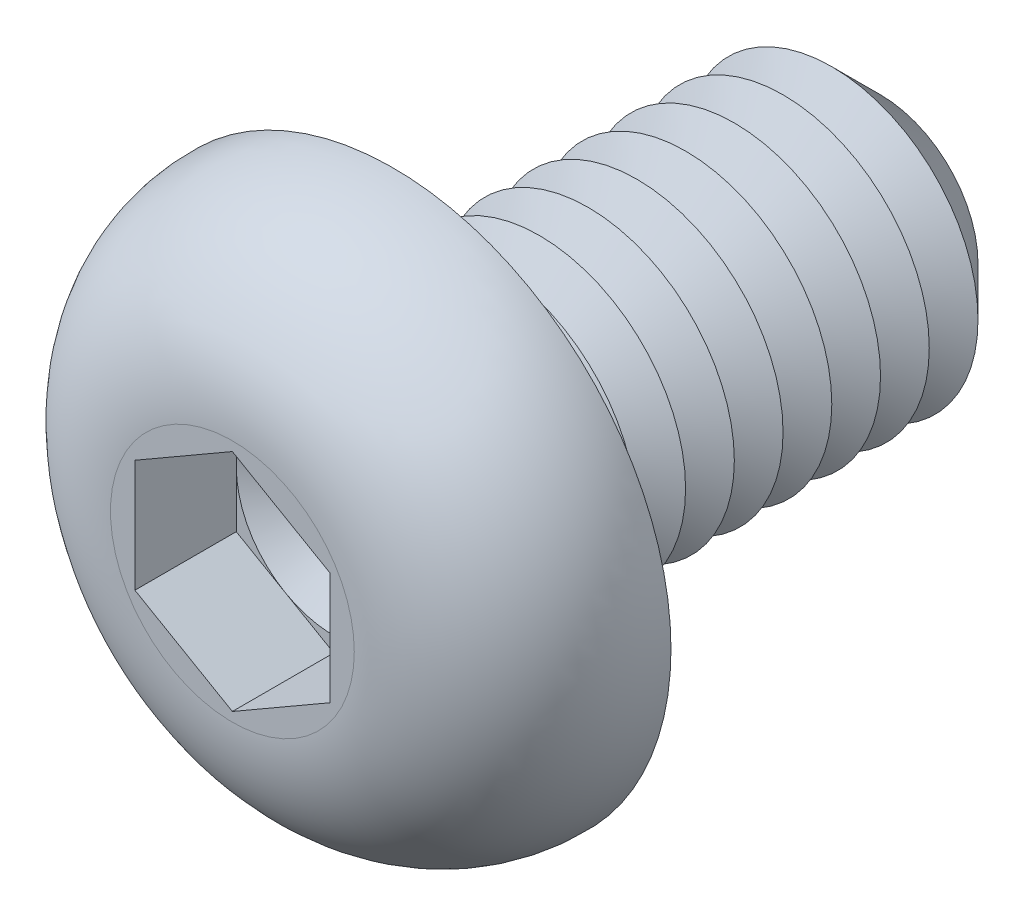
ISO-10303-21;
HEADER;
FILE_DESCRIPTION(('STEP AP214'),'2;1');
FILE_NAME('part.step','',(''),(''),'','','');
FILE_SCHEMA(('AUTOMOTIVE_DESIGN { 1 0 10303 214 1 1 1 1 }'));
ENDSEC;
DATA;
#1=APPLICATION_CONTEXT('core data for automotive mechanical design processes');
#2=APPLICATION_PROTOCOL_DEFINITION('international standard','automotive_design',2000,#1);
#3=PRODUCT_CONTEXT('',#1,'mechanical');
#4=PRODUCT('Part','Part','',(#3));
#5=PRODUCT_RELATED_PRODUCT_CATEGORY('part','',(#4));
#6=PRODUCT_DEFINITION_FORMATION('','',#4);
#7=PRODUCT_DEFINITION_CONTEXT('part definition',#1,'design');
#8=PRODUCT_DEFINITION('design','',#6,#7);
#9=PRODUCT_DEFINITION_SHAPE('','',#8);
#10=(LENGTH_UNIT() NAMED_UNIT(*) SI_UNIT(.MILLI.,.METRE.));
#11=(NAMED_UNIT(*) PLANE_ANGLE_UNIT() SI_UNIT($,.RADIAN.));
#12=(NAMED_UNIT(*) SI_UNIT($,.STERADIAN.) SOLID_ANGLE_UNIT());
#13=UNCERTAINTY_MEASURE_WITH_UNIT(LENGTH_MEASURE(1.E-05),#10,'distance_accuracy_value','');
#14=(GEOMETRIC_REPRESENTATION_CONTEXT(3) GLOBAL_UNCERTAINTY_ASSIGNED_CONTEXT((#13)) GLOBAL_UNIT_ASSIGNED_CONTEXT((#10,
#11,#12)) REPRESENTATION_CONTEXT('',''));
#15=CARTESIAN_POINT('',(0.,0.,0.));
#16=DIRECTION('',(0.,0.,1.));
#17=DIRECTION('',(1.,0.,0.));
#18=AXIS2_PLACEMENT_3D('',#15,#16,#17);
#19=CARTESIAN_POINT('',(0.,0.,0.61));
#20=DIRECTION('',(0.,0.,1.));
#21=DIRECTION('',(1.,0.,0.));
#22=AXIS2_PLACEMENT_3D('',#19,#20,#21);
#23=PLANE('',#22);
#24=CARTESIAN_POINT('',(0.,0.,0.61));
#25=DIRECTION('',(0.,0.,1.));
#26=DIRECTION('',(1.,0.,0.));
#27=AXIS2_PLACEMENT_3D('',#24,#25,#26);
#28=CIRCLE('',#27,1.);
#29=CARTESIAN_POINT('',(1.,0.,0.61));
#30=VERTEX_POINT('',#29);
#31=CARTESIAN_POINT('',(0.5,0.866025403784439,0.61));
#32=VERTEX_POINT('',#31);
#33=EDGE_CURVE('E117',#30,#32,#28,.T.);
#34=ORIENTED_EDGE('',*,*,#33,.F.);
#35=DIRECTION('',(0.,1.,0.));
#36=VECTOR('',#35,1.);
#37=CARTESIAN_POINT('',(1.,-0.577350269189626,0.61));
#38=LINE('',#37,#36);
#39=CARTESIAN_POINT('',(1.,0.577350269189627,0.61));
#40=VERTEX_POINT('',#39);
#41=EDGE_CURVE('E140',#30,#40,#38,.T.);
#42=ORIENTED_EDGE('',*,*,#41,.T.);
#43=DIRECTION('',(-0.866025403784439,0.5,0.));
#44=VECTOR('',#43,1.);
#45=CARTESIAN_POINT('',(1.,0.577350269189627,0.61));
#46=LINE('',#45,#44);
#47=EDGE_CURVE('E135',#40,#32,#46,.T.);
#48=ORIENTED_EDGE('',*,*,#47,.T.);
#49=EDGE_LOOP('',(#34,#42,#48));
#50=FACE_BOUND('',#49,.T.);
#51=ADVANCED_FACE('F39',(#50),#23,.T.);
#52=CARTESIAN_POINT('',(0.,0.,0.61));
#53=DIRECTION('',(0.,0.,1.));
#54=DIRECTION('',(1.,0.,0.));
#55=AXIS2_PLACEMENT_3D('',#52,#53,#54);
#56=CIRCLE('',#55,1.);
#57=CARTESIAN_POINT('',(-0.5,0.866025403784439,0.61));
#58=VERTEX_POINT('',#57);
#59=EDGE_CURVE('E11',#32,#58,#56,.T.);
#60=ORIENTED_EDGE('',*,*,#59,.F.);
#61=CARTESIAN_POINT('',(0.,1.15470053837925,0.61));
#62=VERTEX_POINT('',#61);
#63=EDGE_CURVE('E130',#32,#62,#46,.T.);
#64=ORIENTED_EDGE('',*,*,#63,.T.);
#65=DIRECTION('',(-0.866025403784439,-0.5,0.));
#66=VECTOR('',#65,1.);
#67=CARTESIAN_POINT('',(0.,1.15470053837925,0.61));
#68=LINE('',#67,#66);
#69=EDGE_CURVE('E132',#62,#58,#68,.T.);
#70=ORIENTED_EDGE('',*,*,#69,.T.);
#71=EDGE_LOOP('',(#60,#64,#70));
#72=FACE_BOUND('',#71,.T.);
#73=ADVANCED_FACE('F129',(#72),#23,.T.);
#74=CARTESIAN_POINT('',(-1.,0.,0.61));
#75=VERTEX_POINT('',#74);
#76=EDGE_CURVE('E49',#58,#75,#56,.T.);
#77=ORIENTED_EDGE('',*,*,#76,.F.);
#78=CARTESIAN_POINT('',(-1.,0.577350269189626,0.61));
#79=VERTEX_POINT('',#78);
#80=EDGE_CURVE('E143',#58,#79,#68,.T.);
#81=ORIENTED_EDGE('',*,*,#80,.T.);
#82=DIRECTION('',(0.,-1.,0.));
#83=VECTOR('',#82,1.);
#84=CARTESIAN_POINT('',(-1.,0.577350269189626,0.61));
#85=LINE('',#84,#83);
#86=EDGE_CURVE('E154',#79,#75,#85,.T.);
#87=ORIENTED_EDGE('',*,*,#86,.T.);
#88=EDGE_LOOP('',(#77,#81,#87));
#89=FACE_BOUND('',#88,.T.);
#90=ADVANCED_FACE('F250',(#89),#23,.T.);
#91=CARTESIAN_POINT('',(-0.5,-0.866025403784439,0.61));
#92=VERTEX_POINT('',#91);
#93=EDGE_CURVE('E234',#75,#92,#56,.T.);
#94=ORIENTED_EDGE('',*,*,#93,.F.);
#95=CARTESIAN_POINT('',(-1.,-0.577350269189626,0.61));
#96=VERTEX_POINT('',#95);
#97=EDGE_CURVE('E153',#75,#96,#85,.T.);
#98=ORIENTED_EDGE('',*,*,#97,.T.);
#99=DIRECTION('',(0.866025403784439,-0.5,0.));
#100=VECTOR('',#99,1.);
#101=CARTESIAN_POINT('',(-1.,-0.577350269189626,0.61));
#102=LINE('',#101,#100);
#103=EDGE_CURVE('E159',#96,#92,#102,.T.);
#104=ORIENTED_EDGE('',*,*,#103,.T.);
#105=EDGE_LOOP('',(#94,#98,#104));
#106=FACE_BOUND('',#105,.T.);
#107=ADVANCED_FACE('F243',(#106),#23,.T.);
#108=CARTESIAN_POINT('',(0.5,-0.866025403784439,0.61));
#109=VERTEX_POINT('',#108);
#110=EDGE_CURVE('E56',#92,#109,#56,.T.);
#111=ORIENTED_EDGE('',*,*,#110,.F.);
#112=CARTESIAN_POINT('',(0.,-1.15470053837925,0.61));
#113=VERTEX_POINT('',#112);
#114=EDGE_CURVE('E158',#92,#113,#102,.T.);
#115=ORIENTED_EDGE('',*,*,#114,.T.);
#116=DIRECTION('',(0.866025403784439,0.5,0.));
#117=VECTOR('',#116,1.);
#118=CARTESIAN_POINT('',(0.,-1.15470053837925,0.61));
#119=LINE('',#118,#117);
#120=EDGE_CURVE('E164',#113,#109,#119,.T.);
#121=ORIENTED_EDGE('',*,*,#120,.T.);
#122=EDGE_LOOP('',(#111,#115,#121));
#123=FACE_BOUND('',#122,.T.);
#124=ADVANCED_FACE('F268',(#123),#23,.T.);
#125=CARTESIAN_POINT('',(0.,0.,-5.));
#126=DIRECTION('',(0.,0.,1.));
#127=DIRECTION('',(1.,0.,0.));
#128=AXIS2_PLACEMENT_3D('',#125,#126,#127);
#129=CYLINDRICAL_SURFACE('',#128,1.5);
#130=CARTESIAN_POINT('',(0.,0.,-0.2));
#131=DIRECTION('',(0.,0.,1.));
#132=DIRECTION('',(1.,0.,0.));
#133=AXIS2_PLACEMENT_3D('',#130,#131,#132);
#134=CIRCLE('',#133,1.5);
#135=CARTESIAN_POINT('',(1.5,0.,-0.2));
#136=VERTEX_POINT('',#135);
#137=EDGE_CURVE('E222',#136,#136,#134,.F.);
#138=ORIENTED_EDGE('',*,*,#137,.T.);
#139=EDGE_LOOP('',(#138));
#140=FACE_BOUND('',#139,.T.);
#141=CARTESIAN_POINT('',(0.,0.,-0.5));
#142=DIRECTION('',(0.,0.,1.));
#143=DIRECTION('',(1.,0.,0.));
#144=AXIS2_PLACEMENT_3D('',#141,#142,#143);
#145=CIRCLE('',#144,1.50000000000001);
#146=CARTESIAN_POINT('',(1.50000000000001,0.,-0.5));
#147=VERTEX_POINT('',#146);
#148=EDGE_CURVE('E149',#147,#147,#145,.T.);
#149=ORIENTED_EDGE('',*,*,#148,.T.);
#150=EDGE_LOOP('',(#149));
#151=FACE_BOUND('',#150,.T.);
#152=ADVANCED_FACE('F377',(#140,#151),#129,.T.);
#153=CARTESIAN_POINT('',(0.,2.85,0.));
#154=DIRECTION('',(0.,0.,1.));
#155=DIRECTION('',(1.,0.,0.));
#156=AXIS2_PLACEMENT_3D('',#153,#154,#155);
#157=PLANE('',#156);
#158=CARTESIAN_POINT('',(0.,0.,0.));
#159=DIRECTION('',(0.,0.,1.));
#160=DIRECTION('',(1.,0.,0.));
#161=AXIS2_PLACEMENT_3D('',#158,#159,#160);
#162=CIRCLE('',#161,1.7);
#163=CARTESIAN_POINT('',(1.7,0.,0.));
#164=VERTEX_POINT('',#163);
#165=EDGE_CURVE('E225',#164,#164,#162,.T.);
#166=ORIENTED_EDGE('',*,*,#165,.T.);
#167=EDGE_LOOP('',(#166));
#168=FACE_BOUND('',#167,.T.);
#169=CARTESIAN_POINT('',(0.,0.,0.));
#170=DIRECTION('',(0.,0.,1.));
#171=DIRECTION('',(1.,0.,0.));
#172=AXIS2_PLACEMENT_3D('',#169,#170,#171);
#173=CIRCLE('',#172,2.85);
#174=CARTESIAN_POINT('',(2.85,0.,0.));
#175=VERTEX_POINT('',#174);
#176=EDGE_CURVE('E196',#175,#175,#173,.T.);
#177=ORIENTED_EDGE('',*,*,#176,.F.);
#178=EDGE_LOOP('',(#177));
#179=FACE_BOUND('',#178,.T.);
#180=ADVANCED_FACE('F382',(#168,#179),#157,.F.);
#181=CARTESIAN_POINT('',(0.,0.,1.65));
#182=DIRECTION('',(0.,0.,-1.));
#183=DIRECTION('',(-1.,0.,0.));
#184=AXIS2_PLACEMENT_3D('',#181,#182,#183);
#185=PLANE('',#184);
#186=DIRECTION('',(-0.866025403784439,-0.5,0.));
#187=VECTOR('',#186,1.);
#188=CARTESIAN_POINT('',(0.,1.15470053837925,1.65));
#189=LINE('',#188,#187);
#190=CARTESIAN_POINT('',(0.,1.15470053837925,1.65));
#191=VERTEX_POINT('',#190);
#192=CARTESIAN_POINT('',(-1.,0.577350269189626,1.65));
#193=VERTEX_POINT('',#192);
#194=EDGE_CURVE('E174',#191,#193,#189,.T.);
#195=ORIENTED_EDGE('',*,*,#194,.F.);
#196=DIRECTION('',(-0.866025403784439,0.5,0.));
#197=VECTOR('',#196,1.);
#198=CARTESIAN_POINT('',(1.,0.577350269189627,1.65));
#199=LINE('',#198,#197);
#200=CARTESIAN_POINT('',(1.,0.577350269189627,1.65));
#201=VERTEX_POINT('',#200);
#202=EDGE_CURVE('E64',#201,#191,#199,.T.);
#203=ORIENTED_EDGE('',*,*,#202,.F.);
#204=DIRECTION('',(0.,1.,0.));
#205=VECTOR('',#204,1.);
#206=CARTESIAN_POINT('',(1.,-0.577350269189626,1.65));
#207=LINE('',#206,#205);
#208=CARTESIAN_POINT('',(1.,-0.577350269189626,1.65));
#209=VERTEX_POINT('',#208);
#210=EDGE_CURVE('E138',#209,#201,#207,.T.);
#211=ORIENTED_EDGE('',*,*,#210,.F.);
#212=DIRECTION('',(0.866025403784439,0.5,0.));
#213=VECTOR('',#212,1.);
#214=CARTESIAN_POINT('',(0.,-1.15470053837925,1.65));
#215=LINE('',#214,#213);
#216=CARTESIAN_POINT('',(0.,-1.15470053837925,1.65));
#217=VERTEX_POINT('',#216);
#218=EDGE_CURVE('E186',#217,#209,#215,.T.);
#219=ORIENTED_EDGE('',*,*,#218,.F.);
#220=DIRECTION('',(0.866025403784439,-0.5,0.));
#221=VECTOR('',#220,1.);
#222=CARTESIAN_POINT('',(-1.,-0.577350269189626,1.65));
#223=LINE('',#222,#221);
#224=CARTESIAN_POINT('',(-1.,-0.577350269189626,1.65));
#225=VERTEX_POINT('',#224);
#226=EDGE_CURVE('E182',#225,#217,#223,.T.);
#227=ORIENTED_EDGE('',*,*,#226,.F.);
#228=DIRECTION('',(0.,-1.,0.));
#229=VECTOR('',#228,1.);
#230=CARTESIAN_POINT('',(-1.,0.577350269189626,1.65));
#231=LINE('',#230,#229);
#232=EDGE_CURVE('E178',#193,#225,#231,.T.);
#233=ORIENTED_EDGE('',*,*,#232,.F.);
#234=EDGE_LOOP('',(#195,#203,#211,#219,#227,#233));
#235=FACE_BOUND('',#234,.T.);
#236=CARTESIAN_POINT('',(0.,0.,1.65));
#237=DIRECTION('',(0.,0.,1.));
#238=DIRECTION('',(1.,0.,0.));
#239=AXIS2_PLACEMENT_3D('',#236,#237,#238);
#240=CIRCLE('',#239,1.25078144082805);
#241=CARTESIAN_POINT('',(1.25078144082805,0.,1.65));
#242=VERTEX_POINT('',#241);
#243=EDGE_CURVE('E214',#242,#242,#240,.T.);
#244=ORIENTED_EDGE('',*,*,#243,.T.);
#245=EDGE_LOOP('',(#244));
#246=FACE_BOUND('',#245,.T.);
#247=ADVANCED_FACE('F259',(#235,#246),#185,.F.);
#248=CARTESIAN_POINT('',(0.,0.,0.0499999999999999));
#249=DIRECTION('',(0.,0.,1.));
#250=DIRECTION('',(1.,0.,0.));
#251=AXIS2_PLACEMENT_3D('',#248,#249,#250);
#252=DEGENERATE_TOROIDAL_SURFACE('',#251,1.25078144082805,1.6,.T.);
#253=ORIENTED_EDGE('',*,*,#243,.F.);
#254=EDGE_LOOP('',(#253));
#255=FACE_BOUND('',#254,.T.);
#256=ORIENTED_EDGE('',*,*,#176,.T.);
#257=EDGE_LOOP('',(#256));
#258=FACE_BOUND('',#257,.T.);
#259=ADVANCED_FACE('F593',(#255,#258),#252,.T.);
#260=CARTESIAN_POINT('',(1.,0.577350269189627,0.61));
#261=DIRECTION('',(0.5,0.866025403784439,0.));
#262=DIRECTION('',(-0.866025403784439,0.5,0.));
#263=AXIS2_PLACEMENT_3D('',#260,#261,#262);
#264=PLANE('',#263);
#265=ORIENTED_EDGE('',*,*,#202,.T.);
#266=DIRECTION('',(0.,0.,1.));
#267=VECTOR('',#266,1.);
#268=CARTESIAN_POINT('',(0.,1.15470053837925,0.61));
#269=LINE('',#268,#267);
#270=EDGE_CURVE('E136',#62,#191,#269,.T.);
#271=ORIENTED_EDGE('',*,*,#270,.F.);
#272=ORIENTED_EDGE('',*,*,#63,.F.);
#273=ORIENTED_EDGE('',*,*,#47,.F.);
#274=DIRECTION('',(0.,0.,1.));
#275=VECTOR('',#274,1.);
#276=CARTESIAN_POINT('',(1.,0.577350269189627,0.61));
#277=LINE('',#276,#275);
#278=EDGE_CURVE('E193',#40,#201,#277,.T.);
#279=ORIENTED_EDGE('',*,*,#278,.T.);
#280=EDGE_LOOP('',(#265,#271,#272,#273,#279));
#281=FACE_BOUND('',#280,.T.);
#282=ADVANCED_FACE('F134',(#281),#264,.F.);
#283=CARTESIAN_POINT('',(1.,-0.577350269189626,0.61));
#284=DIRECTION('',(1.,0.,0.));
#285=DIRECTION('',(0.,0.,-1.));
#286=AXIS2_PLACEMENT_3D('',#283,#284,#285);
#287=PLANE('',#286);
#288=ORIENTED_EDGE('',*,*,#210,.T.);
#289=ORIENTED_EDGE('',*,*,#278,.F.);
#290=ORIENTED_EDGE('',*,*,#41,.F.);
#291=CARTESIAN_POINT('',(1.,-0.577350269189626,0.61));
#292=VERTEX_POINT('',#291);
#293=EDGE_CURVE('E168',#292,#30,#38,.T.);
#294=ORIENTED_EDGE('',*,*,#293,.F.);
#295=DIRECTION('',(0.,0.,1.));
#296=VECTOR('',#295,1.);
#297=CARTESIAN_POINT('',(1.,-0.577350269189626,0.61));
#298=LINE('',#297,#296);
#299=EDGE_CURVE('E197',#292,#209,#298,.T.);
#300=ORIENTED_EDGE('',*,*,#299,.T.);
#301=EDGE_LOOP('',(#288,#289,#290,#294,#300));
#302=FACE_BOUND('',#301,.T.);
#303=ADVANCED_FACE('F611',(#302),#287,.F.);
#304=CARTESIAN_POINT('',(0.,-1.15470053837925,0.61));
#305=DIRECTION('',(0.5,-0.866025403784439,0.));
#306=DIRECTION('',(0.866025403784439,0.5,0.));
#307=AXIS2_PLACEMENT_3D('',#304,#305,#306);
#308=PLANE('',#307);
#309=ORIENTED_EDGE('',*,*,#218,.T.);
#310=ORIENTED_EDGE('',*,*,#299,.F.);
#311=EDGE_CURVE('E163',#109,#292,#119,.T.);
#312=ORIENTED_EDGE('',*,*,#311,.F.);
#313=ORIENTED_EDGE('',*,*,#120,.F.);
#314=DIRECTION('',(0.,0.,1.));
#315=VECTOR('',#314,1.);
#316=CARTESIAN_POINT('',(0.,-1.15470053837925,0.61));
#317=LINE('',#316,#315);
#318=EDGE_CURVE('E200',#113,#217,#317,.T.);
#319=ORIENTED_EDGE('',*,*,#318,.T.);
#320=EDGE_LOOP('',(#309,#310,#312,#313,#319));
#321=FACE_BOUND('',#320,.T.);
#322=ADVANCED_FACE('F271',(#321),#308,.F.);
#323=CARTESIAN_POINT('',(-1.,-0.577350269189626,0.61));
#324=DIRECTION('',(-0.5,-0.866025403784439,0.));
#325=DIRECTION('',(0.866025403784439,-0.5,0.));
#326=AXIS2_PLACEMENT_3D('',#323,#324,#325);
#327=PLANE('',#326);
#328=ORIENTED_EDGE('',*,*,#226,.T.);
#329=ORIENTED_EDGE('',*,*,#318,.F.);
#330=ORIENTED_EDGE('',*,*,#114,.F.);
#331=ORIENTED_EDGE('',*,*,#103,.F.);
#332=DIRECTION('',(0.,0.,1.));
#333=VECTOR('',#332,1.);
#334=CARTESIAN_POINT('',(-1.,-0.577350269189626,0.61));
#335=LINE('',#334,#333);
#336=EDGE_CURVE('E203',#96,#225,#335,.T.);
#337=ORIENTED_EDGE('',*,*,#336,.T.);
#338=EDGE_LOOP('',(#328,#329,#330,#331,#337));
#339=FACE_BOUND('',#338,.T.);
#340=ADVANCED_FACE('F264',(#339),#327,.F.);
#341=CARTESIAN_POINT('',(-1.,0.577350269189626,0.61));
#342=DIRECTION('',(-1.,0.,0.));
#343=DIRECTION('',(0.,-1.,0.));
#344=AXIS2_PLACEMENT_3D('',#341,#342,#343);
#345=PLANE('',#344);
#346=ORIENTED_EDGE('',*,*,#232,.T.);
#347=ORIENTED_EDGE('',*,*,#336,.F.);
#348=ORIENTED_EDGE('',*,*,#97,.F.);
#349=ORIENTED_EDGE('',*,*,#86,.F.);
#350=DIRECTION('',(0.,0.,1.));
#351=VECTOR('',#350,1.);
#352=CARTESIAN_POINT('',(-1.,0.577350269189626,0.61));
#353=LINE('',#352,#351);
#354=EDGE_CURVE('E206',#79,#193,#353,.T.);
#355=ORIENTED_EDGE('',*,*,#354,.T.);
#356=EDGE_LOOP('',(#346,#347,#348,#349,#355));
#357=FACE_BOUND('',#356,.T.);
#358=ADVANCED_FACE('F248',(#357),#345,.F.);
#359=CARTESIAN_POINT('',(0.,1.15470053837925,0.61));
#360=DIRECTION('',(-0.5,0.866025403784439,0.));
#361=DIRECTION('',(-0.866025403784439,-0.5,0.));
#362=AXIS2_PLACEMENT_3D('',#359,#360,#361);
#363=PLANE('',#362);
#364=ORIENTED_EDGE('',*,*,#194,.T.);
#365=ORIENTED_EDGE('',*,*,#354,.F.);
#366=ORIENTED_EDGE('',*,*,#80,.F.);
#367=ORIENTED_EDGE('',*,*,#69,.F.);
#368=ORIENTED_EDGE('',*,*,#270,.T.);
#369=EDGE_LOOP('',(#364,#365,#366,#367,#368));
#370=FACE_BOUND('',#369,.T.);
#371=ADVANCED_FACE('F253',(#370),#363,.F.);
#372=EDGE_CURVE('E43',#109,#30,#56,.T.);
#373=ORIENTED_EDGE('',*,*,#372,.F.);
#374=ORIENTED_EDGE('',*,*,#311,.T.);
#375=ORIENTED_EDGE('',*,*,#293,.T.);
#376=EDGE_LOOP('',(#373,#374,#375));
#377=FACE_BOUND('',#376,.T.);
#378=ADVANCED_FACE('F363',(#377),#23,.T.);
#379=CARTESIAN_POINT('',(0.,0.,-0.5));
#380=DIRECTION('',(0.,0.,1.));
#381=DIRECTION('',(1.,0.,0.));
#382=AXIS2_PLACEMENT_3D('',#379,#380,#381);
#383=CONICAL_SURFACE('',#382,1.50000000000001,1.0471975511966);
#384=CARTESIAN_POINT('',(0.,0.,-0.750000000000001));
#385=DIRECTION('',(0.,0.,1.));
#386=DIRECTION('',(1.,0.,0.));
#387=AXIS2_PLACEMENT_3D('',#384,#385,#386);
#388=CIRCLE('',#387,1.06698729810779);
#389=CARTESIAN_POINT('',(1.06698729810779,0.,-0.750000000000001));
#390=VERTEX_POINT('',#389);
#391=EDGE_CURVE('E299',#390,#390,#388,.T.);
#392=ORIENTED_EDGE('',*,*,#391,.T.);
#393=EDGE_LOOP('',(#392));
#394=FACE_BOUND('',#393,.T.);
#395=ORIENTED_EDGE('',*,*,#148,.F.);
#396=EDGE_LOOP('',(#395));
#397=FACE_BOUND('',#396,.T.);
#398=ADVANCED_FACE('F369',(#394,#397),#383,.T.);
#399=CARTESIAN_POINT('',(0.,0.,-0.750000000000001));
#400=DIRECTION('',(0.,0.,-1.));
#401=DIRECTION('',(-1.,0.,0.));
#402=AXIS2_PLACEMENT_3D('',#399,#400,#401);
#403=CONICAL_SURFACE('',#402,1.06698729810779,1.0471975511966);
#404=CARTESIAN_POINT('',(0.,0.,-1.));
#405=DIRECTION('',(0.,0.,1.));
#406=DIRECTION('',(1.,0.,0.));
#407=AXIS2_PLACEMENT_3D('',#404,#405,#406);
#408=CIRCLE('',#407,1.50000000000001);
#409=CARTESIAN_POINT('',(1.50000000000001,0.,-1.));
#410=VERTEX_POINT('',#409);
#411=EDGE_CURVE('E304',#410,#410,#408,.T.);
#412=ORIENTED_EDGE('',*,*,#411,.T.);
#413=EDGE_LOOP('',(#412));
#414=FACE_BOUND('',#413,.T.);
#415=ORIENTED_EDGE('',*,*,#391,.F.);
#416=EDGE_LOOP('',(#415));
#417=FACE_BOUND('',#416,.T.);
#418=ADVANCED_FACE('F374',(#414,#417),#403,.T.);
#419=CARTESIAN_POINT('',(0.,0.,-1.));
#420=DIRECTION('',(0.,0.,1.));
#421=DIRECTION('',(1.,0.,0.));
#422=AXIS2_PLACEMENT_3D('',#419,#420,#421);
#423=CONICAL_SURFACE('',#422,1.50000000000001,1.0471975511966);
#424=CARTESIAN_POINT('',(0.,0.,-1.25));
#425=DIRECTION('',(0.,0.,1.));
#426=DIRECTION('',(1.,0.,0.));
#427=AXIS2_PLACEMENT_3D('',#424,#425,#426);
#428=CIRCLE('',#427,1.06698729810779);
#429=CARTESIAN_POINT('',(1.06698729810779,0.,-1.25));
#430=VERTEX_POINT('',#429);
#431=EDGE_CURVE('E309',#430,#430,#428,.T.);
#432=ORIENTED_EDGE('',*,*,#431,.T.);
#433=EDGE_LOOP('',(#432));
#434=FACE_BOUND('',#433,.T.);
#435=ORIENTED_EDGE('',*,*,#411,.F.);
#436=EDGE_LOOP('',(#435));
#437=FACE_BOUND('',#436,.T.);
#438=ADVANCED_FACE('F552',(#434,#437),#423,.T.);
#439=CARTESIAN_POINT('',(0.,0.,-1.25));
#440=DIRECTION('',(0.,0.,-1.));
#441=DIRECTION('',(-1.,0.,0.));
#442=AXIS2_PLACEMENT_3D('',#439,#440,#441);
#443=CONICAL_SURFACE('',#442,1.06698729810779,1.0471975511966);
#444=CARTESIAN_POINT('',(0.,0.,-1.5));
#445=DIRECTION('',(0.,0.,1.));
#446=DIRECTION('',(1.,0.,0.));
#447=AXIS2_PLACEMENT_3D('',#444,#445,#446);
#448=CIRCLE('',#447,1.50000000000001);
#449=CARTESIAN_POINT('',(1.50000000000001,0.,-1.5));
#450=VERTEX_POINT('',#449);
#451=EDGE_CURVE('E315',#450,#450,#448,.T.);
#452=ORIENTED_EDGE('',*,*,#451,.T.);
#453=EDGE_LOOP('',(#452));
#454=FACE_BOUND('',#453,.T.);
#455=ORIENTED_EDGE('',*,*,#431,.F.);
#456=EDGE_LOOP('',(#455));
#457=FACE_BOUND('',#456,.T.);
#458=ADVANCED_FACE('F542',(#454,#457),#443,.T.);
#459=CARTESIAN_POINT('',(0.,0.,-1.5));
#460=DIRECTION('',(0.,0.,1.));
#461=DIRECTION('',(1.,0.,0.));
#462=AXIS2_PLACEMENT_3D('',#459,#460,#461);
#463=CONICAL_SURFACE('',#462,1.50000000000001,1.0471975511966);
#464=CARTESIAN_POINT('',(0.,0.,-1.75));
#465=DIRECTION('',(0.,0.,1.));
#466=DIRECTION('',(1.,0.,0.));
#467=AXIS2_PLACEMENT_3D('',#464,#465,#466);
#468=CIRCLE('',#467,1.06698729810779);
#469=CARTESIAN_POINT('',(1.06698729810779,0.,-1.75));
#470=VERTEX_POINT('',#469);
#471=EDGE_CURVE('E294',#470,#470,#468,.T.);
#472=ORIENTED_EDGE('',*,*,#471,.T.);
#473=EDGE_LOOP('',(#472));
#474=FACE_BOUND('',#473,.T.);
#475=ORIENTED_EDGE('',*,*,#451,.F.);
#476=EDGE_LOOP('',(#475));
#477=FACE_BOUND('',#476,.T.);
#478=ADVANCED_FACE('F532',(#474,#477),#463,.T.);
#479=CARTESIAN_POINT('',(0.,0.,-1.75));
#480=DIRECTION('',(0.,0.,-1.));
#481=DIRECTION('',(-1.,0.,0.));
#482=AXIS2_PLACEMENT_3D('',#479,#480,#481);
#483=CONICAL_SURFACE('',#482,1.06698729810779,1.0471975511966);
#484=CARTESIAN_POINT('',(0.,0.,-2.));
#485=DIRECTION('',(0.,0.,1.));
#486=DIRECTION('',(1.,0.,0.));
#487=AXIS2_PLACEMENT_3D('',#484,#485,#486);
#488=CIRCLE('',#487,1.50000000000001);
#489=CARTESIAN_POINT('',(1.50000000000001,0.,-2.));
#490=VERTEX_POINT('',#489);
#491=EDGE_CURVE('E292',#490,#490,#488,.T.);
#492=ORIENTED_EDGE('',*,*,#491,.T.);
#493=EDGE_LOOP('',(#492));
#494=FACE_BOUND('',#493,.T.);
#495=ORIENTED_EDGE('',*,*,#471,.F.);
#496=EDGE_LOOP('',(#495));
#497=FACE_BOUND('',#496,.T.);
#498=ADVANCED_FACE('F522',(#494,#497),#483,.T.);
#499=CARTESIAN_POINT('',(0.,0.,-2.));
#500=DIRECTION('',(0.,0.,1.));
#501=DIRECTION('',(1.,0.,0.));
#502=AXIS2_PLACEMENT_3D('',#499,#500,#501);
#503=CONICAL_SURFACE('',#502,1.50000000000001,1.0471975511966);
#504=CARTESIAN_POINT('',(0.,0.,-2.25));
#505=DIRECTION('',(0.,0.,1.));
#506=DIRECTION('',(1.,0.,0.));
#507=AXIS2_PLACEMENT_3D('',#504,#505,#506);
#508=CIRCLE('',#507,1.06698729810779);
#509=CARTESIAN_POINT('',(1.06698729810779,0.,-2.25));
#510=VERTEX_POINT('',#509);
#511=EDGE_CURVE('E289',#510,#510,#508,.T.);
#512=ORIENTED_EDGE('',*,*,#511,.T.);
#513=EDGE_LOOP('',(#512));
#514=FACE_BOUND('',#513,.T.);
#515=ORIENTED_EDGE('',*,*,#491,.F.);
#516=EDGE_LOOP('',(#515));
#517=FACE_BOUND('',#516,.T.);
#518=ADVANCED_FACE('F512',(#514,#517),#503,.T.);
#519=CARTESIAN_POINT('',(0.,0.,-2.25));
#520=DIRECTION('',(0.,0.,-1.));
#521=DIRECTION('',(-1.,0.,0.));
#522=AXIS2_PLACEMENT_3D('',#519,#520,#521);
#523=CONICAL_SURFACE('',#522,1.06698729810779,1.0471975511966);
#524=CARTESIAN_POINT('',(0.,0.,-2.5));
#525=DIRECTION('',(0.,0.,1.));
#526=DIRECTION('',(1.,0.,0.));
#527=AXIS2_PLACEMENT_3D('',#524,#525,#526);
#528=CIRCLE('',#527,1.50000000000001);
#529=CARTESIAN_POINT('',(1.50000000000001,0.,-2.5));
#530=VERTEX_POINT('',#529);
#531=EDGE_CURVE('E285',#530,#530,#528,.T.);
#532=ORIENTED_EDGE('',*,*,#531,.T.);
#533=EDGE_LOOP('',(#532));
#534=FACE_BOUND('',#533,.T.);
#535=ORIENTED_EDGE('',*,*,#511,.F.);
#536=EDGE_LOOP('',(#535));
#537=FACE_BOUND('',#536,.T.);
#538=ADVANCED_FACE('F502',(#534,#537),#523,.T.);
#539=CARTESIAN_POINT('',(0.,0.,-2.5));
#540=DIRECTION('',(0.,0.,1.));
#541=DIRECTION('',(1.,0.,0.));
#542=AXIS2_PLACEMENT_3D('',#539,#540,#541);
#543=CONICAL_SURFACE('',#542,1.50000000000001,1.0471975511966);
#544=CARTESIAN_POINT('',(0.,0.,-2.75));
#545=DIRECTION('',(0.,0.,1.));
#546=DIRECTION('',(1.,0.,0.));
#547=AXIS2_PLACEMENT_3D('',#544,#545,#546);
#548=CIRCLE('',#547,1.06698729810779);
#549=CARTESIAN_POINT('',(1.06698729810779,0.,-2.75));
#550=VERTEX_POINT('',#549);
#551=EDGE_CURVE('E283',#550,#550,#548,.T.);
#552=ORIENTED_EDGE('',*,*,#551,.T.);
#553=EDGE_LOOP('',(#552));
#554=FACE_BOUND('',#553,.T.);
#555=ORIENTED_EDGE('',*,*,#531,.F.);
#556=EDGE_LOOP('',(#555));
#557=FACE_BOUND('',#556,.T.);
#558=ADVANCED_FACE('F492',(#554,#557),#543,.T.);
#559=CARTESIAN_POINT('',(0.,0.,-2.75));
#560=DIRECTION('',(0.,0.,-1.));
#561=DIRECTION('',(-1.,0.,0.));
#562=AXIS2_PLACEMENT_3D('',#559,#560,#561);
#563=CONICAL_SURFACE('',#562,1.06698729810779,1.0471975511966);
#564=CARTESIAN_POINT('',(0.,0.,-3.));
#565=DIRECTION('',(0.,0.,1.));
#566=DIRECTION('',(1.,0.,0.));
#567=AXIS2_PLACEMENT_3D('',#564,#565,#566);
#568=CIRCLE('',#567,1.50000000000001);
#569=CARTESIAN_POINT('',(1.50000000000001,0.,-3.));
#570=VERTEX_POINT('',#569);
#571=EDGE_CURVE('E277',#570,#570,#568,.T.);
#572=ORIENTED_EDGE('',*,*,#571,.T.);
#573=EDGE_LOOP('',(#572));
#574=FACE_BOUND('',#573,.T.);
#575=ORIENTED_EDGE('',*,*,#551,.F.);
#576=EDGE_LOOP('',(#575));
#577=FACE_BOUND('',#576,.T.);
#578=ADVANCED_FACE('F482',(#574,#577),#563,.T.);
#579=CARTESIAN_POINT('',(0.,0.,-3.));
#580=DIRECTION('',(0.,0.,1.));
#581=DIRECTION('',(1.,0.,0.));
#582=AXIS2_PLACEMENT_3D('',#579,#580,#581);
#583=CONICAL_SURFACE('',#582,1.50000000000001,1.0471975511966);
#584=CARTESIAN_POINT('',(0.,0.,-3.25));
#585=DIRECTION('',(0.,0.,1.));
#586=DIRECTION('',(1.,0.,0.));
#587=AXIS2_PLACEMENT_3D('',#584,#585,#586);
#588=CIRCLE('',#587,1.06698729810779);
#589=CARTESIAN_POINT('',(1.06698729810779,0.,-3.25));
#590=VERTEX_POINT('',#589);
#591=EDGE_CURVE('E326',#590,#590,#588,.T.);
#592=ORIENTED_EDGE('',*,*,#591,.T.);
#593=EDGE_LOOP('',(#592));
#594=FACE_BOUND('',#593,.T.);
#595=ORIENTED_EDGE('',*,*,#571,.F.);
#596=EDGE_LOOP('',(#595));
#597=FACE_BOUND('',#596,.T.);
#598=ADVANCED_FACE('F472',(#594,#597),#583,.T.);
#599=CARTESIAN_POINT('',(0.,0.,-3.25));
#600=DIRECTION('',(0.,0.,-1.));
#601=DIRECTION('',(-1.,0.,0.));
#602=AXIS2_PLACEMENT_3D('',#599,#600,#601);
#603=CONICAL_SURFACE('',#602,1.06698729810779,1.0471975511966);
#604=CARTESIAN_POINT('',(0.,0.,-3.5));
#605=DIRECTION('',(0.,0.,1.));
#606=DIRECTION('',(1.,0.,0.));
#607=AXIS2_PLACEMENT_3D('',#604,#605,#606);
#608=CIRCLE('',#607,1.50000000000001);
#609=CARTESIAN_POINT('',(1.50000000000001,0.,-3.5));
#610=VERTEX_POINT('',#609);
#611=EDGE_CURVE('E329',#610,#610,#608,.T.);
#612=ORIENTED_EDGE('',*,*,#611,.T.);
#613=EDGE_LOOP('',(#612));
#614=FACE_BOUND('',#613,.T.);
#615=ORIENTED_EDGE('',*,*,#591,.F.);
#616=EDGE_LOOP('',(#615));
#617=FACE_BOUND('',#616,.T.);
#618=ADVANCED_FACE('F462',(#614,#617),#603,.T.);
#619=CARTESIAN_POINT('',(0.,0.,-3.5));
#620=DIRECTION('',(0.,0.,1.));
#621=DIRECTION('',(1.,0.,0.));
#622=AXIS2_PLACEMENT_3D('',#619,#620,#621);
#623=CONICAL_SURFACE('',#622,1.50000000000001,1.0471975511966);
#624=CARTESIAN_POINT('',(0.,0.,-3.75));
#625=DIRECTION('',(0.,0.,1.));
#626=DIRECTION('',(1.,0.,0.));
#627=AXIS2_PLACEMENT_3D('',#624,#625,#626);
#628=CIRCLE('',#627,1.06698729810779);
#629=CARTESIAN_POINT('',(1.06698729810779,0.,-3.75));
#630=VERTEX_POINT('',#629);
#631=EDGE_CURVE('E333',#630,#630,#628,.T.);
#632=ORIENTED_EDGE('',*,*,#631,.T.);
#633=EDGE_LOOP('',(#632));
#634=FACE_BOUND('',#633,.T.);
#635=ORIENTED_EDGE('',*,*,#611,.F.);
#636=EDGE_LOOP('',(#635));
#637=FACE_BOUND('',#636,.T.);
#638=ADVANCED_FACE('F452',(#634,#637),#623,.T.);
#639=CARTESIAN_POINT('',(0.,0.,-3.75));
#640=DIRECTION('',(0.,0.,-1.));
#641=DIRECTION('',(-1.,0.,0.));
#642=AXIS2_PLACEMENT_3D('',#639,#640,#641);
#643=CONICAL_SURFACE('',#642,1.06698729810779,1.0471975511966);
#644=CARTESIAN_POINT('',(0.,0.,-4.));
#645=DIRECTION('',(0.,0.,1.));
#646=DIRECTION('',(1.,0.,0.));
#647=AXIS2_PLACEMENT_3D('',#644,#645,#646);
#648=CIRCLE('',#647,1.50000000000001);
#649=CARTESIAN_POINT('',(1.50000000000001,0.,-4.));
#650=VERTEX_POINT('',#649);
#651=EDGE_CURVE('E336',#650,#650,#648,.T.);
#652=ORIENTED_EDGE('',*,*,#651,.T.);
#653=EDGE_LOOP('',(#652));
#654=FACE_BOUND('',#653,.T.);
#655=ORIENTED_EDGE('',*,*,#631,.F.);
#656=EDGE_LOOP('',(#655));
#657=FACE_BOUND('',#656,.T.);
#658=ADVANCED_FACE('F442',(#654,#657),#643,.T.);
#659=CARTESIAN_POINT('',(0.,0.,-4.));
#660=DIRECTION('',(0.,0.,1.));
#661=DIRECTION('',(1.,0.,0.));
#662=AXIS2_PLACEMENT_3D('',#659,#660,#661);
#663=CONICAL_SURFACE('',#662,1.50000000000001,1.0471975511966);
#664=CARTESIAN_POINT('',(0.,0.,-4.25));
#665=DIRECTION('',(0.,0.,1.));
#666=DIRECTION('',(1.,0.,0.));
#667=AXIS2_PLACEMENT_3D('',#664,#665,#666);
#668=CIRCLE('',#667,1.06698729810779);
#669=CARTESIAN_POINT('',(1.06698729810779,0.,-4.25));
#670=VERTEX_POINT('',#669);
#671=EDGE_CURVE('E124',#670,#670,#668,.T.);
#672=ORIENTED_EDGE('',*,*,#671,.T.);
#673=EDGE_LOOP('',(#672));
#674=FACE_BOUND('',#673,.T.);
#675=ORIENTED_EDGE('',*,*,#651,.F.);
#676=EDGE_LOOP('',(#675));
#677=FACE_BOUND('',#676,.T.);
#678=ADVANCED_FACE('F357',(#674,#677),#663,.T.);
#679=CARTESIAN_POINT('',(0.,0.,-4.25));
#680=DIRECTION('',(0.,0.,-1.));
#681=DIRECTION('',(-1.,0.,0.));
#682=AXIS2_PLACEMENT_3D('',#679,#680,#681);
#683=CONICAL_SURFACE('',#682,1.06698729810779,1.0471975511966);
#684=CARTESIAN_POINT('',(0.,0.,-4.5));
#685=DIRECTION('',(0.,0.,1.));
#686=DIRECTION('',(1.,0.,0.));
#687=AXIS2_PLACEMENT_3D('',#684,#685,#686);
#688=CIRCLE('',#687,1.50000000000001);
#689=CARTESIAN_POINT('',(1.50000000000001,0.,-4.5));
#690=VERTEX_POINT('',#689);
#691=EDGE_CURVE('E281',#690,#690,#688,.T.);
#692=ORIENTED_EDGE('',*,*,#691,.T.);
#693=EDGE_LOOP('',(#692));
#694=FACE_BOUND('',#693,.T.);
#695=ORIENTED_EDGE('',*,*,#671,.F.);
#696=EDGE_LOOP('',(#695));
#697=FACE_BOUND('',#696,.T.);
#698=ADVANCED_FACE('F343',(#694,#697),#683,.T.);
#699=CARTESIAN_POINT('',(0.,0.,-5.));
#700=DIRECTION('',(0.,0.,-1.));
#701=DIRECTION('',(-1.,0.,0.));
#702=AXIS2_PLACEMENT_3D('',#699,#700,#701);
#703=PLANE('',#702);
#704=CARTESIAN_POINT('',(0.,0.,-5.));
#705=DIRECTION('',(0.,0.,-1.));
#706=DIRECTION('',(-1.,0.,0.));
#707=AXIS2_PLACEMENT_3D('',#704,#705,#706);
#708=CIRCLE('',#707,1.);
#709=CARTESIAN_POINT('',(-1.,0.,-5.));
#710=VERTEX_POINT('',#709);
#711=EDGE_CURVE('E218',#710,#710,#708,.T.);
#712=ORIENTED_EDGE('',*,*,#711,.T.);
#713=EDGE_LOOP('',(#712));
#714=FACE_BOUND('',#713,.T.);
#715=ADVANCED_FACE('F349',(#714),#703,.T.);
#716=CARTESIAN_POINT('',(0.,0.,-5.));
#717=DIRECTION('',(0.,0.,1.));
#718=DIRECTION('',(1.,0.,0.));
#719=AXIS2_PLACEMENT_3D('',#716,#717,#718);
#720=CONICAL_SURFACE('',#719,1.,0.785398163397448);
#721=ORIENTED_EDGE('',*,*,#691,.F.);
#722=EDGE_LOOP('',(#721));
#723=FACE_BOUND('',#722,.T.);
#724=ORIENTED_EDGE('',*,*,#711,.F.);
#725=EDGE_LOOP('',(#724));
#726=FACE_BOUND('',#725,.T.);
#727=ADVANCED_FACE('F346',(#723,#726),#720,.T.);
#728=CARTESIAN_POINT('',(0.,0.,-0.2));
#729=DIRECTION('',(0.,0.,1.));
#730=DIRECTION('',(1.,0.,0.));
#731=AXIS2_PLACEMENT_3D('',#728,#729,#730);
#732=TOROIDAL_SURFACE('',#731,1.7,0.2);
#733=ORIENTED_EDGE('',*,*,#165,.F.);
#734=EDGE_LOOP('',(#733));
#735=FACE_BOUND('',#734,.T.);
#736=ORIENTED_EDGE('',*,*,#137,.F.);
#737=EDGE_LOOP('',(#736));
#738=FACE_BOUND('',#737,.T.);
#739=ADVANCED_FACE('F41',(#735,#738),#732,.F.);
#740=CARTESIAN_POINT('',(0.,0.,0.61));
#741=DIRECTION('',(0.,0.,1.));
#742=DIRECTION('',(1.,0.,0.));
#743=AXIS2_PLACEMENT_3D('',#740,#741,#742);
#744=CONICAL_SURFACE('',#743,1.,1.0471975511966);
#745=CARTESIAN_POINT('',(0.,0.,0.0326497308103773));
#746=VERTEX_POINT('',#745);
#747=VERTEX_LOOP('',#746);
#748=FACE_BOUND('',#747,.T.);
#749=ORIENTED_EDGE('',*,*,#33,.T.);
#750=ORIENTED_EDGE('',*,*,#59,.T.);
#751=ORIENTED_EDGE('',*,*,#76,.T.);
#752=ORIENTED_EDGE('',*,*,#93,.T.);
#753=ORIENTED_EDGE('',*,*,#110,.T.);
#754=ORIENTED_EDGE('',*,*,#372,.T.);
#755=EDGE_LOOP('',(#749,#750,#751,#752,#753,#754));
#756=FACE_BOUND('',#755,.T.);
#757=ADVANCED_FACE('F113',(#748,#756),#744,.F.);
#758=CLOSED_SHELL('',(#51,#73,#90,#107,#124,#152,#180,#247,#259,#282,#303,#322,#340,#358,#371,
#378,#398,#418,#438,#458,#478,#498,#518,#538,#558,#578,#598,#618,#638,#658,#678,#698,#715,#727,
#739,#757));
#759=MANIFOLD_SOLID_BREP('B2',#758);
#760=ADVANCED_BREP_SHAPE_REPRESENTATION('',(#18,#759),#14);
#761=SHAPE_DEFINITION_REPRESENTATION(#9,#760);
ENDSEC;
END-ISO-10303-21;
